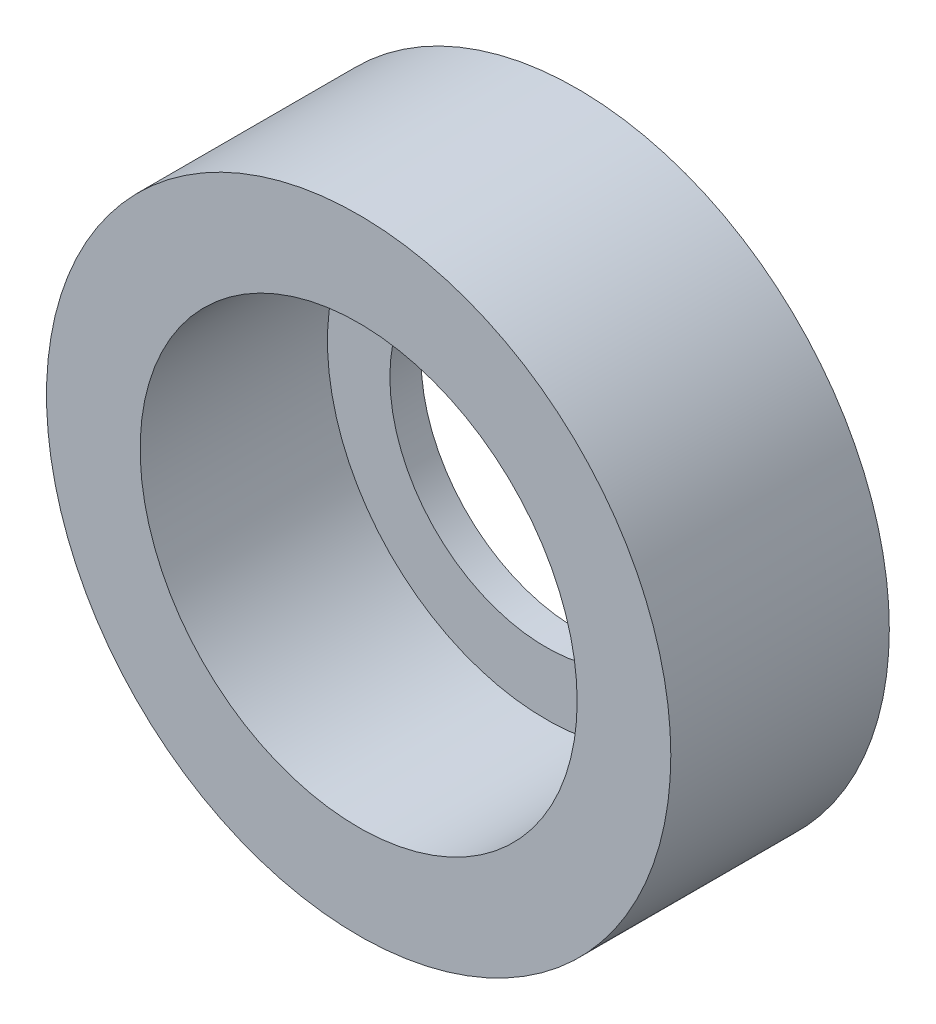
ISO-10303-21;
HEADER;
FILE_DESCRIPTION(('STEP AP214'),'2;1');
FILE_NAME('part.step','',(''),(''),'','','');
FILE_SCHEMA(('AUTOMOTIVE_DESIGN { 1 0 10303 214 1 1 1 1 }'));
ENDSEC;
DATA;
#1=APPLICATION_CONTEXT('core data for automotive mechanical design processes');
#2=APPLICATION_PROTOCOL_DEFINITION('international standard','automotive_design',2000,#1);
#3=PRODUCT_CONTEXT('',#1,'mechanical');
#4=PRODUCT('Part','Part','',(#3));
#5=PRODUCT_RELATED_PRODUCT_CATEGORY('part','',(#4));
#6=PRODUCT_DEFINITION_FORMATION('','',#4);
#7=PRODUCT_DEFINITION_CONTEXT('part definition',#1,'design');
#8=PRODUCT_DEFINITION('design','',#6,#7);
#9=PRODUCT_DEFINITION_SHAPE('','',#8);
#10=(LENGTH_UNIT() NAMED_UNIT(*) SI_UNIT(.MILLI.,.METRE.));
#11=(NAMED_UNIT(*) PLANE_ANGLE_UNIT() SI_UNIT($,.RADIAN.));
#12=(NAMED_UNIT(*) SI_UNIT($,.STERADIAN.) SOLID_ANGLE_UNIT());
#13=UNCERTAINTY_MEASURE_WITH_UNIT(LENGTH_MEASURE(1.E-05),#10,'distance_accuracy_value','');
#14=(GEOMETRIC_REPRESENTATION_CONTEXT(3) GLOBAL_UNCERTAINTY_ASSIGNED_CONTEXT((#13)) GLOBAL_UNIT_ASSIGNED_CONTEXT((#10,
#11,#12)) REPRESENTATION_CONTEXT('',''));
#15=CARTESIAN_POINT('',(0.,0.,0.));
#16=DIRECTION('',(0.,0.,1.));
#17=DIRECTION('',(1.,0.,0.));
#18=AXIS2_PLACEMENT_3D('',#15,#16,#17);
#19=CARTESIAN_POINT('',(0.,0.,3.5));
#20=DIRECTION('',(0.,0.,-1.));
#21=DIRECTION('',(-1.,0.,0.));
#22=AXIS2_PLACEMENT_3D('',#19,#20,#21);
#23=CYLINDRICAL_SURFACE('',#22,5.);
#24=CARTESIAN_POINT('',(0.,0.,3.5));
#25=DIRECTION('',(0.,0.,1.));
#26=DIRECTION('',(1.,0.,0.));
#27=AXIS2_PLACEMENT_3D('',#24,#25,#26);
#28=CIRCLE('',#27,5.);
#29=CARTESIAN_POINT('',(5.,0.,3.5));
#30=VERTEX_POINT('',#29);
#31=EDGE_CURVE('E10',#30,#30,#28,.T.);
#32=ORIENTED_EDGE('',*,*,#31,.F.);
#33=EDGE_LOOP('',(#32));
#34=FACE_BOUND('',#33,.T.);
#35=CARTESIAN_POINT('',(0.,0.,0.));
#36=DIRECTION('',(0.,0.,1.));
#37=DIRECTION('',(1.,0.,0.));
#38=AXIS2_PLACEMENT_3D('',#35,#36,#37);
#39=CIRCLE('',#38,5.);
#40=CARTESIAN_POINT('',(5.,0.,0.));
#41=VERTEX_POINT('',#40);
#42=EDGE_CURVE('E33',#41,#41,#39,.T.);
#43=ORIENTED_EDGE('',*,*,#42,.T.);
#44=EDGE_LOOP('',(#43));
#45=FACE_BOUND('',#44,.T.);
#46=ADVANCED_FACE('F26',(#34,#45),#23,.T.);
#47=CARTESIAN_POINT('',(0.,0.,3.5));
#48=DIRECTION('',(0.,0.,1.));
#49=DIRECTION('',(1.,0.,0.));
#50=AXIS2_PLACEMENT_3D('',#47,#48,#49);
#51=PLANE('',#50);
#52=CARTESIAN_POINT('',(0.,0.,3.5));
#53=DIRECTION('',(0.,0.,1.));
#54=DIRECTION('',(1.,0.,0.));
#55=AXIS2_PLACEMENT_3D('',#52,#53,#54);
#56=CIRCLE('',#55,3.49999999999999);
#57=CARTESIAN_POINT('',(3.49999999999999,0.,3.5));
#58=VERTEX_POINT('',#57);
#59=EDGE_CURVE('E42',#58,#58,#56,.T.);
#60=ORIENTED_EDGE('',*,*,#59,.F.);
#61=EDGE_LOOP('',(#60));
#62=FACE_BOUND('',#61,.T.);
#63=ORIENTED_EDGE('',*,*,#31,.T.);
#64=EDGE_LOOP('',(#63));
#65=FACE_BOUND('',#64,.T.);
#66=ADVANCED_FACE('F66',(#62,#65),#51,.T.);
#67=CARTESIAN_POINT('',(0.,0.,0.));
#68=DIRECTION('',(0.,0.,1.));
#69=DIRECTION('',(1.,0.,0.));
#70=AXIS2_PLACEMENT_3D('',#67,#68,#69);
#71=PLANE('',#70);
#72=CARTESIAN_POINT('',(0.,0.,0.));
#73=DIRECTION('',(0.,0.,-1.));
#74=DIRECTION('',(-1.,0.,0.));
#75=AXIS2_PLACEMENT_3D('',#72,#73,#74);
#76=CIRCLE('',#75,2.5);
#77=CARTESIAN_POINT('',(-2.5,0.,0.));
#78=VERTEX_POINT('',#77);
#79=EDGE_CURVE('E45',#78,#78,#76,.T.);
#80=ORIENTED_EDGE('',*,*,#79,.F.);
#81=EDGE_LOOP('',(#80));
#82=FACE_BOUND('',#81,.T.);
#83=ORIENTED_EDGE('',*,*,#42,.F.);
#84=EDGE_LOOP('',(#83));
#85=FACE_BOUND('',#84,.T.);
#86=ADVANCED_FACE('F71',(#82,#85),#71,.F.);
#87=CARTESIAN_POINT('',(0.,0.,0.5));
#88=DIRECTION('',(0.,0.,-1.));
#89=DIRECTION('',(-1.,0.,0.));
#90=AXIS2_PLACEMENT_3D('',#87,#88,#89);
#91=PLANE('',#90);
#92=CARTESIAN_POINT('',(0.,0.,0.5));
#93=DIRECTION('',(0.,0.,-1.));
#94=DIRECTION('',(-1.,0.,0.));
#95=AXIS2_PLACEMENT_3D('',#92,#93,#94);
#96=CIRCLE('',#95,2.5);
#97=CARTESIAN_POINT('',(-2.5,0.,0.5));
#98=VERTEX_POINT('',#97);
#99=EDGE_CURVE('E29',#98,#98,#96,.T.);
#100=ORIENTED_EDGE('',*,*,#99,.T.);
#101=EDGE_LOOP('',(#100));
#102=FACE_BOUND('',#101,.T.);
#103=CARTESIAN_POINT('',(0.,0.,0.5));
#104=DIRECTION('',(0.,0.,1.));
#105=DIRECTION('',(1.,0.,0.));
#106=AXIS2_PLACEMENT_3D('',#103,#104,#105);
#107=CIRCLE('',#106,3.5);
#108=CARTESIAN_POINT('',(3.5,0.,0.5));
#109=VERTEX_POINT('',#108);
#110=EDGE_CURVE('E37',#109,#109,#107,.T.);
#111=ORIENTED_EDGE('',*,*,#110,.T.);
#112=EDGE_LOOP('',(#111));
#113=FACE_BOUND('',#112,.T.);
#114=ADVANCED_FACE('F52',(#102,#113),#91,.F.);
#115=CARTESIAN_POINT('',(0.,0.,3.5));
#116=DIRECTION('',(0.,0.,1.));
#117=DIRECTION('',(1.,0.,0.));
#118=AXIS2_PLACEMENT_3D('',#115,#116,#117);
#119=CYLINDRICAL_SURFACE('',#118,3.49999999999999);
#120=ORIENTED_EDGE('',*,*,#110,.F.);
#121=EDGE_LOOP('',(#120));
#122=FACE_BOUND('',#121,.T.);
#123=ORIENTED_EDGE('',*,*,#59,.T.);
#124=EDGE_LOOP('',(#123));
#125=FACE_BOUND('',#124,.T.);
#126=ADVANCED_FACE('F57',(#122,#125),#119,.F.);
#127=CARTESIAN_POINT('',(0.,0.,3.5));
#128=DIRECTION('',(0.,0.,-1.));
#129=DIRECTION('',(-1.,0.,0.));
#130=AXIS2_PLACEMENT_3D('',#127,#128,#129);
#131=CYLINDRICAL_SURFACE('',#130,2.5);
#132=ORIENTED_EDGE('',*,*,#79,.T.);
#133=EDGE_LOOP('',(#132));
#134=FACE_BOUND('',#133,.T.);
#135=ORIENTED_EDGE('',*,*,#99,.F.);
#136=EDGE_LOOP('',(#135));
#137=FACE_BOUND('',#136,.T.);
#138=ADVANCED_FACE('F55',(#134,#137),#131,.F.);
#139=CLOSED_SHELL('',(#46,#66,#86,#114,#126,#138));
#140=MANIFOLD_SOLID_BREP('B2',#139);
#141=ADVANCED_BREP_SHAPE_REPRESENTATION('',(#18,#140),#14);
#142=SHAPE_DEFINITION_REPRESENTATION(#9,#141);
ENDSEC;
END-ISO-10303-21;
